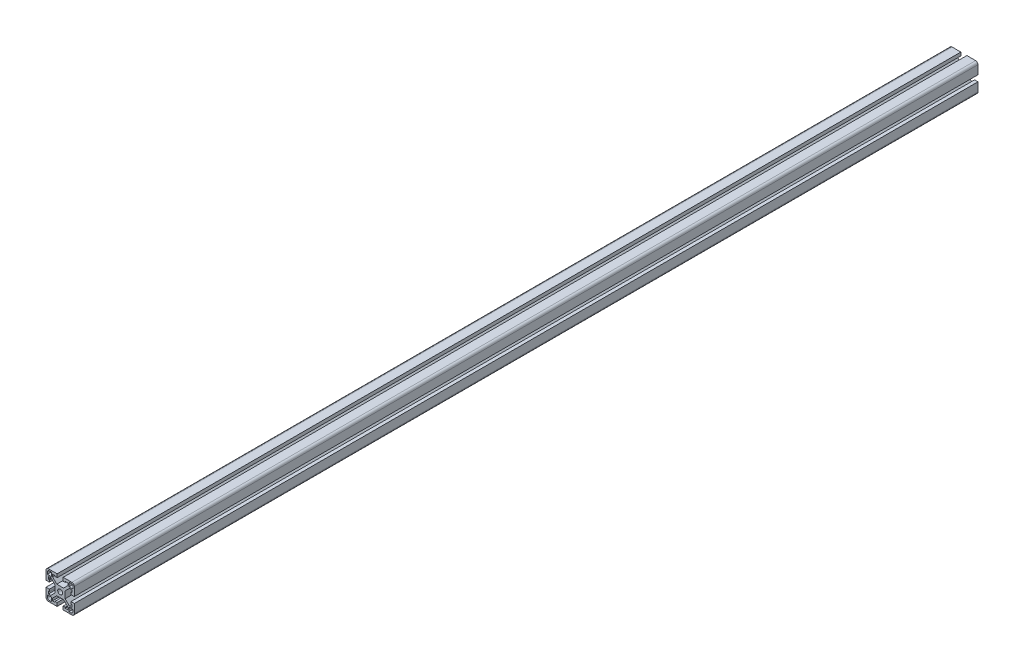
from build123d import *

# Parameters (mm, degrees)
SKETCH1_R           = 3.2639
BOSS_EXTRUDE1_DEPTH = 1217.803


with BuildPart() as part:
    # Sketch1 → Boss-Extrude1 (new body)
    with BuildSketch(Plane.XY):
        with BuildLine():
            Line((-6.731, 4.575738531), (-6.731, -4.575738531))
            Line((-6.731, -4.575738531), (-12.442261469, -10.287))
            Line((-12.442261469, -10.287), (-15.6718, -10.287))
            Line((-15.6718, -10.287), (-15.6718, -6.858))
            Line((-15.6718, -6.858), (-14.478, -6.858))
            Line((-14.478, -6.858), (-14.478, -4.064))
            Line((-14.478, -4.064), (-19.05, -4.064))
            Line((-19.05, -4.064), (-19.05, -15.875))
            ThreePointArc((-19.05, -15.875), (-18.12006403, -18.12006403), (-15.875, -19.05))
            Line((-15.875, -19.05), (-4.064, -19.05))
            Line((-4.064, -19.05), (-4.064, -14.478))
            Line((-4.064, -14.478), (-6.858, -14.478))
            Line((-6.858, -14.478), (-6.858, -15.6718))
            Line((-6.858, -15.6718), (-10.287, -15.6718))
            Line((-10.287, -15.6718), (-10.287, -12.442261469))
            Line((-10.287, -12.442261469), (-4.575738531, -6.731))
            Line((-4.575738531, -6.731), (4.575738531, -6.731))
            Line((4.575738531, -6.731), (10.287, -12.442261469))
            Line((10.287, -12.442261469), (10.287, -15.6718))
            Line((10.287, -15.6718), (6.858, -15.6718))
            Line((6.858, -15.6718), (6.858, -14.478))
            Line((6.858, -14.478), (4.064, -14.478))
            Line((4.064, -14.478), (4.064, -19.05))
            Line((4.064, -19.05), (15.875, -19.05))
            ThreePointArc((15.875, -19.05), (18.12006403, -18.12006403), (19.05, -15.875))
            Line((19.05, -15.875), (19.05, -4.064))
            Line((19.05, -4.064), (14.478, -4.064))
            Line((14.478, -4.064), (14.478, -6.858))
            Line((14.478, -6.858), (15.6718, -6.858))
            Line((15.6718, -6.858), (15.6718, -10.287))
            Line((15.6718, -10.287), (12.442261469, -10.287))
            Line((12.442261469, -10.287), (6.731, -4.575738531))
            Line((6.731, -4.575738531), (6.731, 4.575738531))
            Line((6.731, 4.575738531), (12.442261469, 10.287))
            Line((12.442261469, 10.287), (15.6718, 10.287))
            Line((15.6718, 10.287), (15.6718, 6.858))
            Line((15.6718, 6.858), (14.478, 6.858))
            Line((14.478, 6.858), (14.478, 4.064))
            Line((14.478, 4.064), (19.05, 4.064))
            Line((19.05, 4.064), (19.05, 15.875))
            ThreePointArc((19.05, 15.875), (18.12006403, 18.12006403), (15.875, 19.05))
            Line((15.875, 19.05), (4.064, 19.05))
            Line((4.064, 19.05), (4.064, 14.478))
            Line((4.064, 14.478), (6.858, 14.478))
            Line((6.858, 14.478), (6.858, 15.6718))
            Line((6.858, 15.6718), (10.287, 15.6718))
            Line((10.287, 15.6718), (10.287, 12.442261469))
            Line((10.287, 12.442261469), (4.575738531, 6.731))
            Line((4.575738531, 6.731), (-4.575738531, 6.731))
            Line((-4.575738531, 6.731), (-10.287, 12.442261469))
            Line((-10.287, 12.442261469), (-10.287, 15.6718))
            Line((-10.287, 15.6718), (-6.858, 15.6718))
            Line((-6.858, 15.6718), (-6.858, 14.478))
            Line((-6.858, 14.478), (-4.064, 14.478))
            Line((-4.064, 14.478), (-4.064, 19.05))
            Line((-4.064, 19.05), (-15.875, 19.05))
            ThreePointArc((-15.875, 19.05), (-18.12006403, 18.12006403), (-19.05, 15.875))
            Line((-19.05, 15.875), (-19.05, 4.064))
            Line((-19.05, 4.064), (-14.478, 4.064))
            Line((-14.478, 4.064), (-14.478, 6.858))
            Line((-14.478, 6.858), (-15.6718, 6.858))
            Line((-15.6718, 6.858), (-15.6718, 10.287))
            Line((-15.6718, 10.287), (-12.442261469, 10.287))
            Line((-12.442261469, 10.287), (-6.731, 4.575738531))
        make_face()
        Circle(SKETCH1_R, mode=Mode.SUBTRACT)
        with BuildLine():
            Line((-11.8872, 17.272), (-14.478, 17.272))
            ThreePointArc((-14.478, 17.272), (-16.453656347, 16.453656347), (-17.272, 14.478))
            Line((-17.272, 14.478), (-17.272, 11.8872))
            Line((-17.272, 11.8872), (-11.8872, 11.8872))
            Line((-11.8872, 11.8872), (-11.8872, 17.272))
        make_face(mode=Mode.SUBTRACT)
        with BuildLine():
            Line((14.478, 17.272), (11.8872, 17.272))
            Line((11.8872, 17.272), (11.8872, 11.8872))
            Line((11.8872, 11.8872), (17.272, 11.8872))
            Line((17.272, 11.8872), (17.272, 14.478))
            ThreePointArc((17.272, 14.478), (16.453656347, 16.453656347), (14.478, 17.272))
        make_face(mode=Mode.SUBTRACT)
        with BuildLine():
            Line((11.8872, -17.272), (14.478, -17.272))
            ThreePointArc((14.478, -17.272), (16.453656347, -16.453656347), (17.272, -14.478))
            Line((17.272, -14.478), (17.272, -11.8872))
            Line((17.272, -11.8872), (11.8872, -11.8872))
            Line((11.8872, -11.8872), (11.8872, -17.272))
        make_face(mode=Mode.SUBTRACT)
        with BuildLine():
            Line((-14.478, -17.272), (-11.8872, -17.272))
            Line((-11.8872, -17.272), (-11.8872, -11.8872))
            Line((-11.8872, -11.8872), (-17.272, -11.8872))
            Line((-17.272, -11.8872), (-17.272, -14.478))
            ThreePointArc((-17.272, -14.478), (-16.453656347, -16.453656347), (-14.478, -17.272))
        make_face(mode=Mode.SUBTRACT)
    extrude(amount=-BOSS_EXTRUDE1_DEPTH)


solid = part.part
